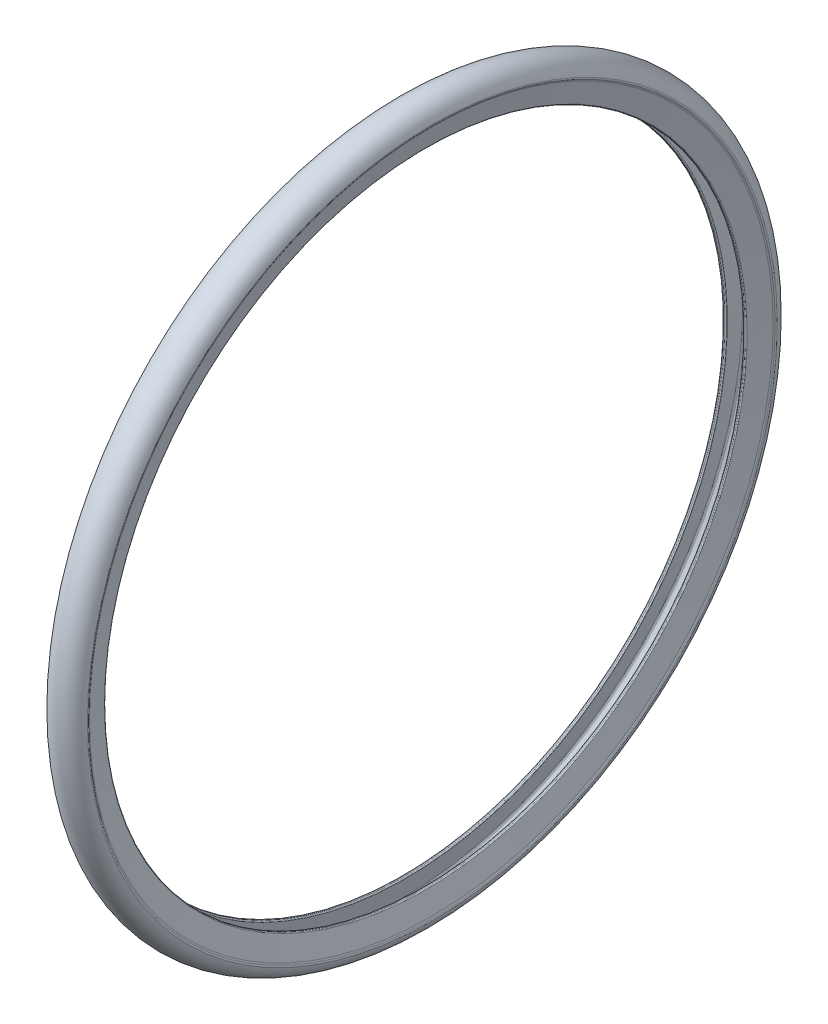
from build123d import *


with BuildPart() as part:
    # Sketch2 → Revolve3 (revolve)
    with BuildSketch(Plane.XY, mode=Mode.PRIVATE) as revolve3_sk:
        with BuildLine():
            Line((-15.927669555, 26.610768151), (-10.886565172, 7.695918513))
            ThreePointArc((-10.886565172, 7.695918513), (-10.529585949, 7.160499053), (-9.920293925, 6.953444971))
            Line((-9.920293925, 6.953444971), (-8.885387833, 6.953444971))
            ThreePointArc((-8.885387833, 6.953444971), (-8.092441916, 7.344152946), (-7.919116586, 8.210971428))
            Line((-7.919116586, 8.210971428), (-13.062387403, 27.509162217))
            ThreePointArc((-13.062387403, 27.509162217), (-13.036037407, 28.62954988), (-12.411160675, 29.559868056))
            ThreePointArc((-12.411160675, 29.559868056), (-0.136328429, 34.355186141), (12.552414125, 30.796760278))
            ThreePointArc((12.552414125, 30.796760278), (13.289741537, 29.875659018), (13.379556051, 28.69921837))
            Line((13.379556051, 28.69921837), (7.919116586, 8.210971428))
            ThreePointArc((7.919116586, 8.210971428), (8.092441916, 7.344152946), (8.885387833, 6.953444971))
            Line((8.885387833, 6.953444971), (9.920293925, 6.953444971))
            ThreePointArc((9.920293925, 6.953444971), (10.529585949, 7.160499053), (10.886565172, 7.695918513))
            Line((10.886565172, 7.695918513), (15.927669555, 26.610768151))
            ThreePointArc((15.927669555, 26.610768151), (16.191963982, 27.307607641), (16.592015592, 27.936412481))
            ThreePointArc((16.592015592, 27.936412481), (16.953403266, 28.698800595), (16.945474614, 29.542467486))
            ThreePointArc((16.945474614, 29.542467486), (11.263489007, 38.774568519), (1.222679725, 42.860984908))
            ThreePointArc((1.222679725, 42.860984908), (-10.302781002, 39.532084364), (-16.945474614, 29.542467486))
            ThreePointArc((-16.945474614, 29.542467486), (-16.953403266, 28.698800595), (-16.592015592, 27.936412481))
            ThreePointArc((-16.592015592, 27.936412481), (-16.191963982, 27.307607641), (-15.927669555, 26.610768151))
        make_face()
    revolve(revolve3_sk.sketch.rotate(Axis((-43.107593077, -289.525905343, 0), (1, 0, 0)), 90), axis=Axis((-43.107593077, -289.525905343, 0), (1, 0, 0)))


solid = part.part
